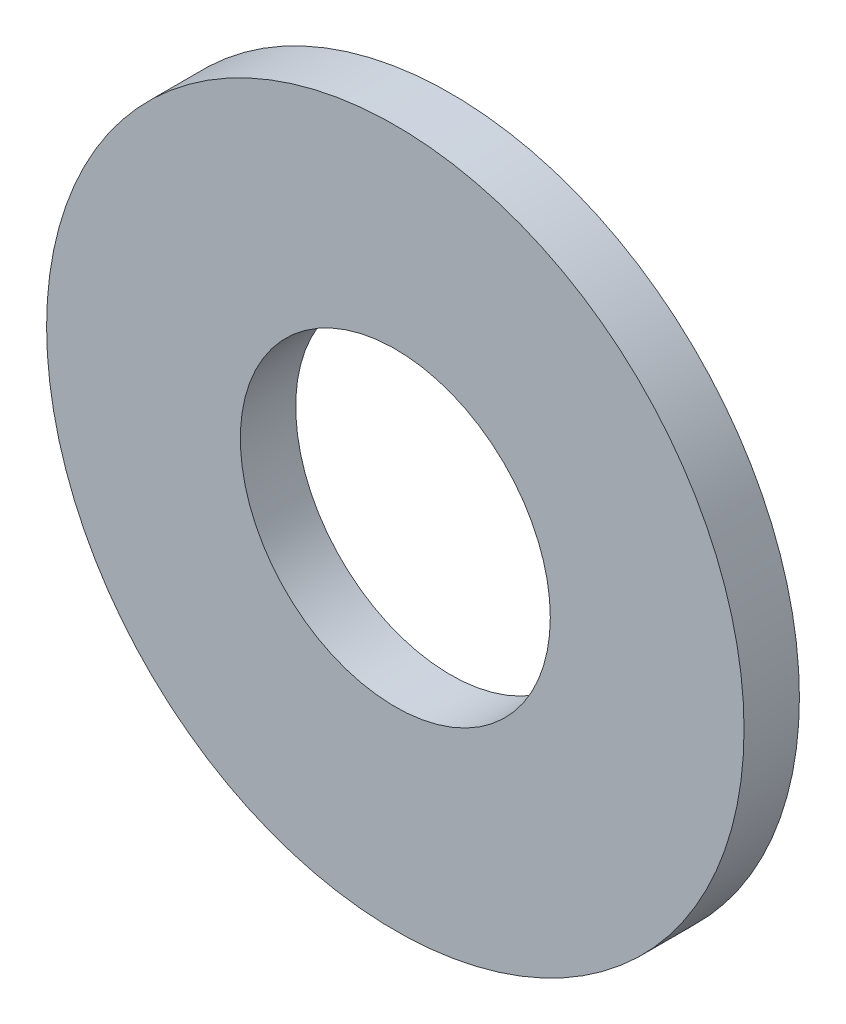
from build123d import *

# Parameters (mm, degrees)
SKETCH1_R      = 8.001
SKETCH1_R_2    = 3.556
EXTRUDE1_DEPTH = 1.27


with BuildPart() as part:
    # Sketch1 → Extrude1 (new body)
    with BuildSketch(Plane.XY):
        Circle(SKETCH1_R)
        Circle(SKETCH1_R_2, mode=Mode.SUBTRACT)
    extrude(amount=-EXTRUDE1_DEPTH)


solid = part.part
